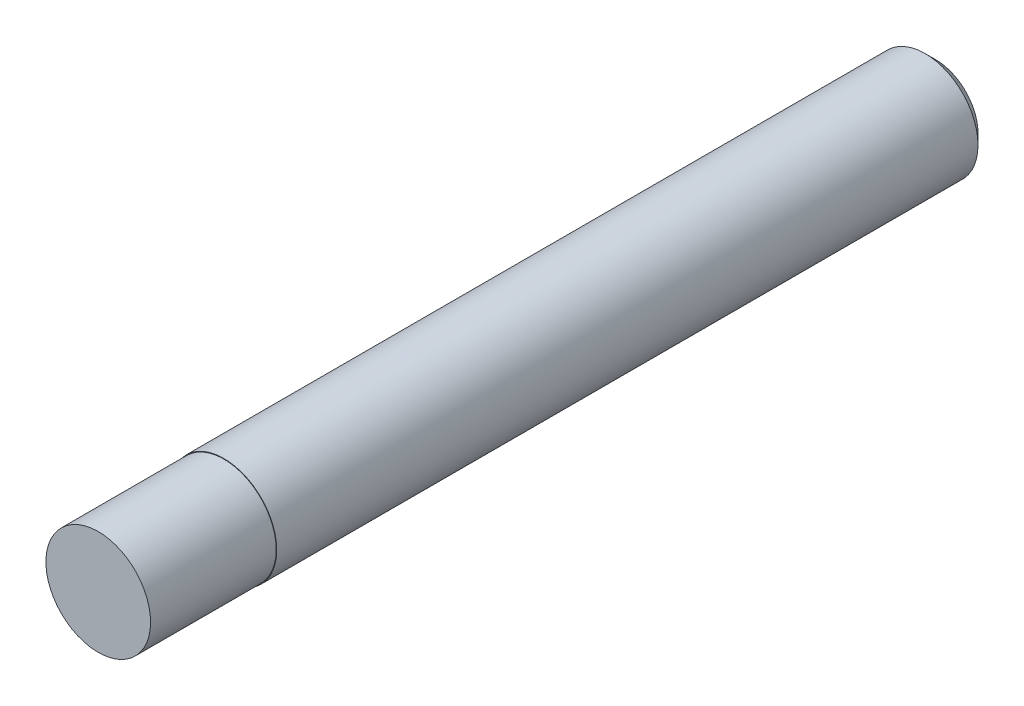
from build123d import *

# Parameters (mm, degrees)
ESQUISSE1_R        = 2.525
BOSS_EXTRU_1_DEPTH = 34
ESQUISSE2_R        = 2.5
BOSS_EXTRU_2_DEPTH = 6
CHANFREIN1_SIZE    = 0.5


with BuildPart() as part:
    # Esquisse1 → Boss.-Extru.1 (new body)
    with BuildSketch(Plane.XY):
        Circle(ESQUISSE1_R)
    extrude(amount=BOSS_EXTRU_1_DEPTH)

    # Esquisse2 → Boss.-Extru.2 (add)
    with BuildSketch(Plane.XY.offset(34)):
        Circle(ESQUISSE2_R)
    extrude(amount=BOSS_EXTRU_2_DEPTH)

    # Chanfrein1
    chanfrein1_edges = [part.edges().sort_by_distance(p)[0] for p in [
        (-2.525, 0, 0),
    ]]
    chamfer(chanfrein1_edges, length=CHANFREIN1_SIZE)


solid = part.part
